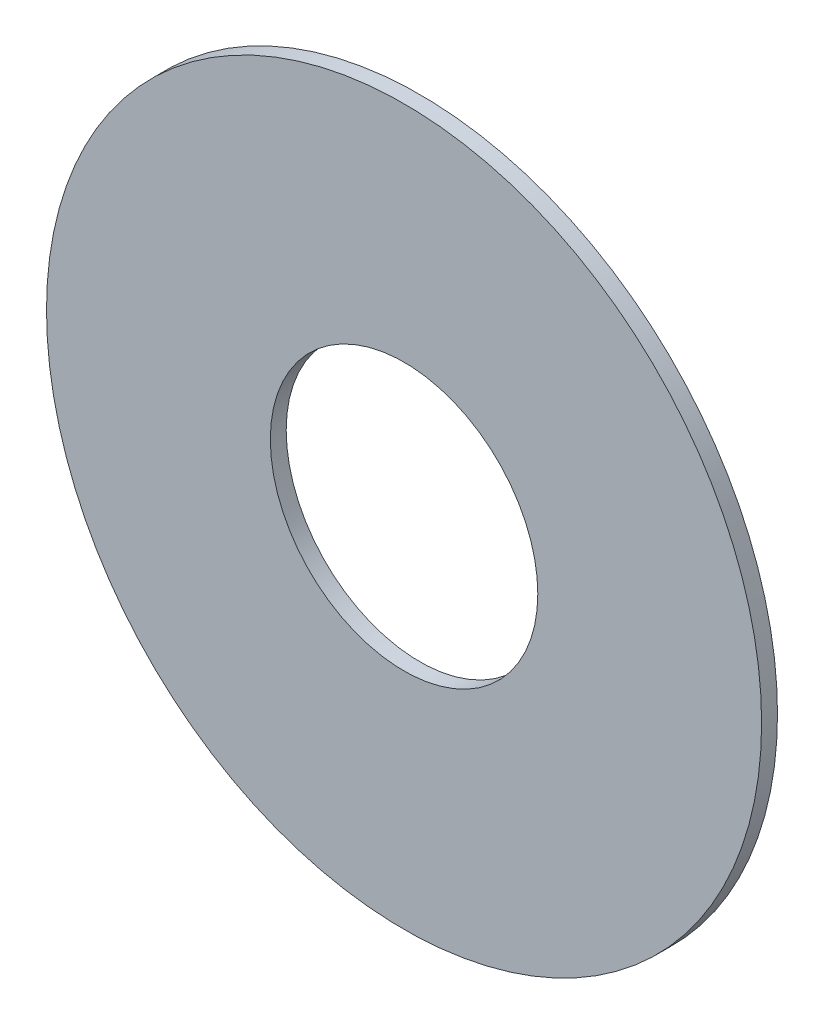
from build123d import *

# Parameters (mm, degrees)
SKETCH2_R          = 17.145
SKETCH2_R_2        = 6.4135
BASE_EXTRUDE_DEPTH = 0.762


with BuildPart() as part:
    # Sketch2 → Base-Extrude (new body)
    with BuildSketch(Plane.XY):
        with Locations(Location((0, 0, 0), (0, 0, 180))):
            Circle(SKETCH2_R)
        with Locations(Location((0, 0, 0), (0, 0, 180))):
            Circle(SKETCH2_R_2, mode=Mode.SUBTRACT)
    extrude(amount=BASE_EXTRUDE_DEPTH)


solid = part.part
